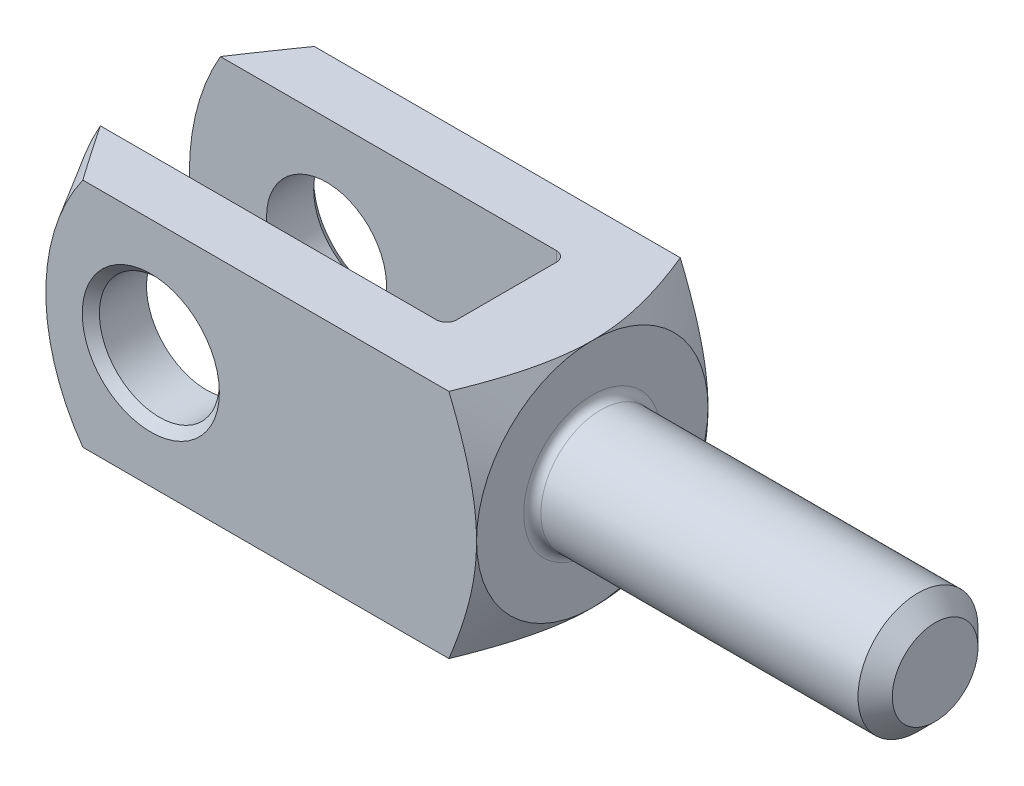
ISO-10303-21;
HEADER;
FILE_DESCRIPTION(('STEP AP214'),'2;1');
FILE_NAME('part.step','',(''),(''),'','','');
FILE_SCHEMA(('AUTOMOTIVE_DESIGN { 1 0 10303 214 1 1 1 1 }'));
ENDSEC;
DATA;
#1=APPLICATION_CONTEXT('core data for automotive mechanical design processes');
#2=APPLICATION_PROTOCOL_DEFINITION('international standard','automotive_design',2000,#1);
#3=PRODUCT_CONTEXT('',#1,'mechanical');
#4=PRODUCT('Part','Part','',(#3));
#5=PRODUCT_RELATED_PRODUCT_CATEGORY('part','',(#4));
#6=PRODUCT_DEFINITION_FORMATION('','',#4);
#7=PRODUCT_DEFINITION_CONTEXT('part definition',#1,'design');
#8=PRODUCT_DEFINITION('design','',#6,#7);
#9=PRODUCT_DEFINITION_SHAPE('','',#8);
#10=(LENGTH_UNIT() NAMED_UNIT(*) SI_UNIT(.MILLI.,.METRE.));
#11=(NAMED_UNIT(*) PLANE_ANGLE_UNIT() SI_UNIT($,.RADIAN.));
#12=(NAMED_UNIT(*) SI_UNIT($,.STERADIAN.) SOLID_ANGLE_UNIT());
#13=UNCERTAINTY_MEASURE_WITH_UNIT(LENGTH_MEASURE(1.E-05),#10,'distance_accuracy_value','');
#14=(GEOMETRIC_REPRESENTATION_CONTEXT(3) GLOBAL_UNCERTAINTY_ASSIGNED_CONTEXT((#13)) GLOBAL_UNIT_ASSIGNED_CONTEXT((#10,
#11,#12)) REPRESENTATION_CONTEXT('',''));
#15=CARTESIAN_POINT('',(0.,0.,0.));
#16=DIRECTION('',(0.,0.,1.));
#17=DIRECTION('',(1.,0.,0.));
#18=AXIS2_PLACEMENT_3D('',#15,#16,#17);
#19=CARTESIAN_POINT('',(-94.,-13.5,-6.99999999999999));
#20=DIRECTION('',(0.,0.,-1.));
#21=DIRECTION('',(-1.,0.,0.));
#22=AXIS2_PLACEMENT_3D('',#19,#20,#21);
#23=PLANE('',#22);
#24=CARTESIAN_POINT('',(-78.,0.,-6.99999999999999));
#25=DIRECTION('',(0.,0.,-1.));
#26=DIRECTION('',(-1.,0.,0.));
#27=AXIS2_PLACEMENT_3D('',#24,#25,#26);
#28=CIRCLE('',#27,7.);
#29=CARTESIAN_POINT('',(-85.,0.,-6.99999999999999));
#30=VERTEX_POINT('',#29);
#31=EDGE_CURVE('E160',#30,#30,#28,.F.);
#32=ORIENTED_EDGE('',*,*,#31,.F.);
#33=EDGE_LOOP('',(#32));
#34=FACE_BOUND('',#33,.T.);
#35=DIRECTION('',(-1.,0.,0.));
#36=VECTOR('',#35,1.);
#37=CARTESIAN_POINT('',(-94.,13.5,-6.99999999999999));
#38=LINE('',#37,#36);
#39=CARTESIAN_POINT('',(-51.2,13.5,-6.99999999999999));
#40=VERTEX_POINT('',#39);
#41=CARTESIAN_POINT('',(-90.3826859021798,13.5,-6.99999999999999));
#42=VERTEX_POINT('',#41);
#43=EDGE_CURVE('E320',#40,#42,#38,.T.);
#44=ORIENTED_EDGE('',*,*,#43,.T.);
#45=CARTESIAN_POINT('',(-67.,0.,-6.99999999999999));
#46=DIRECTION('',(0.,0.,1.));
#47=DIRECTION('',(1.,0.,0.));
#48=AXIS2_PLACEMENT_3D('',#45,#46,#47);
#49=CIRCLE('',#48,27.);
#50=CARTESIAN_POINT('',(-90.3826859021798,-13.5,-6.99999999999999));
#51=VERTEX_POINT('',#50);
#52=EDGE_CURVE('E61',#42,#51,#49,.T.);
#53=ORIENTED_EDGE('',*,*,#52,.T.);
#54=DIRECTION('',(-1.,0.,0.));
#55=VECTOR('',#54,1.);
#56=CARTESIAN_POINT('',(-94.,-13.5,-6.99999999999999));
#57=LINE('',#56,#55);
#58=CARTESIAN_POINT('',(-51.2,-13.5,-6.99999999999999));
#59=VERTEX_POINT('',#58);
#60=EDGE_CURVE('E312',#59,#51,#57,.T.);
#61=ORIENTED_EDGE('',*,*,#60,.F.);
#62=DIRECTION('',(0.,1.,0.));
#63=VECTOR('',#62,1.);
#64=CARTESIAN_POINT('',(-51.2,13.5,-6.99999999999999));
#65=LINE('',#64,#63);
#66=EDGE_CURVE('E183',#59,#40,#65,.T.);
#67=ORIENTED_EDGE('',*,*,#66,.T.);
#68=EDGE_LOOP('',(#44,#53,#61,#67));
#69=FACE_BOUND('',#68,.T.);
#70=ADVANCED_FACE('F37',(#34,#69),#23,.F.);
#71=CARTESIAN_POINT('',(-94.,-13.5,7.00000000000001));
#72=DIRECTION('',(0.,0.,1.));
#73=DIRECTION('',(1.,0.,0.));
#74=AXIS2_PLACEMENT_3D('',#71,#72,#73);
#75=PLANE('',#74);
#76=CARTESIAN_POINT('',(-78.,0.,7.00000000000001));
#77=DIRECTION('',(0.,0.,1.));
#78=DIRECTION('',(1.,0.,0.));
#79=AXIS2_PLACEMENT_3D('',#76,#77,#78);
#80=CIRCLE('',#79,7.);
#81=CARTESIAN_POINT('',(-71.,0.,7.00000000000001));
#82=VERTEX_POINT('',#81);
#83=EDGE_CURVE('E164',#82,#82,#80,.F.);
#84=ORIENTED_EDGE('',*,*,#83,.F.);
#85=EDGE_LOOP('',(#84));
#86=FACE_BOUND('',#85,.T.);
#87=CARTESIAN_POINT('',(-67.,0.,7.00000000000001));
#88=DIRECTION('',(0.,0.,1.));
#89=DIRECTION('',(1.,0.,0.));
#90=AXIS2_PLACEMENT_3D('',#87,#88,#89);
#91=CIRCLE('',#90,27.);
#92=CARTESIAN_POINT('',(-90.3826859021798,13.5,7.00000000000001));
#93=VERTEX_POINT('',#92);
#94=CARTESIAN_POINT('',(-90.3826859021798,-13.5,7.00000000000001));
#95=VERTEX_POINT('',#94);
#96=EDGE_CURVE('E128',#93,#95,#91,.T.);
#97=ORIENTED_EDGE('',*,*,#96,.F.);
#98=DIRECTION('',(1.,0.,0.));
#99=VECTOR('',#98,1.);
#100=CARTESIAN_POINT('',(-94.,13.5,7.00000000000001));
#101=LINE('',#100,#99);
#102=CARTESIAN_POINT('',(-51.2,13.5,7.));
#103=VERTEX_POINT('',#102);
#104=EDGE_CURVE('E324',#93,#103,#101,.T.);
#105=ORIENTED_EDGE('',*,*,#104,.T.);
#106=DIRECTION('',(0.,1.,0.));
#107=VECTOR('',#106,1.);
#108=CARTESIAN_POINT('',(-51.2,-13.5,7.));
#109=LINE('',#108,#107);
#110=CARTESIAN_POINT('',(-51.2,-13.5,7.));
#111=VERTEX_POINT('',#110);
#112=EDGE_CURVE('E179',#103,#111,#109,.F.);
#113=ORIENTED_EDGE('',*,*,#112,.T.);
#114=DIRECTION('',(1.,0.,0.));
#115=VECTOR('',#114,1.);
#116=CARTESIAN_POINT('',(-94.,-13.5,7.00000000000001));
#117=LINE('',#116,#115);
#118=EDGE_CURVE('E314',#95,#111,#117,.T.);
#119=ORIENTED_EDGE('',*,*,#118,.F.);
#120=EDGE_LOOP('',(#97,#105,#113,#119));
#121=FACE_BOUND('',#120,.T.);
#122=ADVANCED_FACE('F388',(#86,#121),#75,.F.);
#123=CARTESIAN_POINT('',(-94.,-13.5,13.5));
#124=DIRECTION('',(0.,0.,1.));
#125=DIRECTION('',(1.,0.,0.));
#126=AXIS2_PLACEMENT_3D('',#123,#124,#125);
#127=PLANE('',#126);
#128=CARTESIAN_POINT('',(-78.,0.,13.5));
#129=DIRECTION('',(0.,0.,1.));
#130=DIRECTION('',(1.,0.,0.));
#131=AXIS2_PLACEMENT_3D('',#128,#129,#130);
#132=CIRCLE('',#131,8.00000000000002);
#133=CARTESIAN_POINT('',(-70.,0.,13.5));
#134=VERTEX_POINT('',#133);
#135=EDGE_CURVE('E220',#134,#134,#132,.F.);
#136=ORIENTED_EDGE('',*,*,#135,.T.);
#137=EDGE_LOOP('',(#136));
#138=FACE_BOUND('',#137,.T.);
#139=DIRECTION('',(1.,0.,0.));
#140=VECTOR('',#139,1.);
#141=CARTESIAN_POINT('',(-94.,13.5,13.5));
#142=LINE('',#141,#140);
#143=CARTESIAN_POINT('',(-85.9257335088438,13.5,13.5));
#144=VERTEX_POINT('',#143);
#145=CARTESIAN_POINT('',(-43.2284752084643,13.5,13.5));
#146=VERTEX_POINT('',#145);
#147=EDGE_CURVE('E142',#144,#146,#142,.T.);
#148=ORIENTED_EDGE('',*,*,#147,.F.);
#149=CARTESIAN_POINT('',(-67.,0.,13.5));
#150=DIRECTION('',(0.,0.,1.));
#151=DIRECTION('',(1.,0.,0.));
#152=AXIS2_PLACEMENT_3D('',#149,#150,#151);
#153=CIRCLE('',#152,23.2472232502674);
#154=CARTESIAN_POINT('',(-85.9257335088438,-13.5,13.5));
#155=VERTEX_POINT('',#154);
#156=EDGE_CURVE('E53',#144,#155,#153,.T.);
#157=ORIENTED_EDGE('',*,*,#156,.T.);
#158=DIRECTION('',(1.,0.,0.));
#159=VECTOR('',#158,1.);
#160=CARTESIAN_POINT('',(-94.,-13.5,13.5));
#161=LINE('',#160,#159);
#162=CARTESIAN_POINT('',(-43.2284752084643,-13.5,13.5));
#163=VERTEX_POINT('',#162);
#164=EDGE_CURVE('E139',#155,#163,#161,.T.);
#165=ORIENTED_EDGE('',*,*,#164,.T.);
#166=CARTESIAN_POINT('',(-49.9304291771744,-27.5724587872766,13.5));
#167=CARTESIAN_POINT('',(-49.5854679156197,-26.9070980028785,13.5));
#168=CARTESIAN_POINT('',(-49.242330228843,-26.240782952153,13.5));
#169=CARTESIAN_POINT('',(-48.5606693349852,-24.9057532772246,13.5));
#170=CARTESIAN_POINT('',(-48.222146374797,-24.2370385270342,13.5));
#171=CARTESIAN_POINT('',(-47.5501346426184,-22.8956223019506,13.5));
#172=CARTESIAN_POINT('',(-47.2166556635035,-22.2229159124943,13.5));
#173=CARTESIAN_POINT('',(-46.5567154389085,-20.8740781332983,13.5));
#174=CARTESIAN_POINT('',(-46.2302540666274,-20.1979468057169,13.5));
#175=CARTESIAN_POINT('',(-45.5663268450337,-18.7997650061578,13.5));
#176=CARTESIAN_POINT('',(-45.2294196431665,-18.0774486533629,13.5));
#177=CARTESIAN_POINT('',(-44.5684159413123,-16.6268968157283,13.5));
#178=CARTESIAN_POINT('',(-44.2443201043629,-15.8986610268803,13.5));
#179=CARTESIAN_POINT('',(-43.7709527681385,-14.8009827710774,13.5));
#180=CARTESIAN_POINT('',(-43.6153242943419,-14.4342798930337,13.5));
#181=CARTESIAN_POINT('',(-43.3089711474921,-13.6988341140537,13.5));
#182=CARTESIAN_POINT('',(-43.1582463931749,-13.3300912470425,13.5));
#183=CARTESIAN_POINT('',(-42.8624766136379,-12.5903643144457,13.5));
#184=CARTESIAN_POINT('',(-42.717431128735,-12.2193804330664,13.5));
#185=CARTESIAN_POINT('',(-42.4339241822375,-11.4749116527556,13.5));
#186=CARTESIAN_POINT('',(-42.2954625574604,-11.1014268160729,13.5));
#187=CARTESIAN_POINT('',(-41.9969840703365,-10.2704027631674,13.5));
#188=CARTESIAN_POINT('',(-41.8388043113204,-9.81219978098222,13.5));
#189=CARTESIAN_POINT('',(-41.5360567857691,-8.89133812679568,13.5));
#190=CARTESIAN_POINT('',(-41.3914878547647,-8.42867983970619,13.5));
#191=CARTESIAN_POINT('',(-41.1186454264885,-7.49855908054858,13.5));
#192=CARTESIAN_POINT('',(-40.9903715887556,-7.03109670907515,13.5));
#193=CARTESIAN_POINT('',(-40.753182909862,-6.09124666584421,13.5));
#194=CARTESIAN_POINT('',(-40.6442678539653,-5.61885904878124,13.5));
#195=CARTESIAN_POINT('',(-40.4513715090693,-4.68052707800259,13.5));
#196=CARTESIAN_POINT('',(-40.3668649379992,-4.21469177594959,13.5));
#197=CARTESIAN_POINT('',(-40.2224231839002,-3.27919491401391,13.5));
#198=CARTESIAN_POINT('',(-40.162487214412,-2.80953347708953,13.5));
#199=CARTESIAN_POINT('',(-40.0696920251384,-1.86781820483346,13.5));
#200=CARTESIAN_POINT('',(-40.0368151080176,-1.39576613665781,13.5));
#201=CARTESIAN_POINT('',(-39.9995884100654,-0.450533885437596,13.5));
#202=CARTESIAN_POINT('',(-39.9952376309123,0.0226462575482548,13.5));
#203=CARTESIAN_POINT('',(-40.0145298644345,0.933916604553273,13.5));
#204=CARTESIAN_POINT('',(-40.0361561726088,1.37205133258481,13.5));
#205=CARTESIAN_POINT('',(-40.1032147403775,2.24647569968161,13.5));
#206=CARTESIAN_POINT('',(-40.1486469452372,2.68276534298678,13.5));
#207=CARTESIAN_POINT('',(-40.2616517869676,3.55266413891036,13.5));
#208=CARTESIAN_POINT('',(-40.3292358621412,3.98627178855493,13.5));
#209=CARTESIAN_POINT('',(-40.4843161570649,4.84988834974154,13.5));
#210=CARTESIAN_POINT('',(-40.5718129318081,5.27989716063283,13.5));
#211=CARTESIAN_POINT('',(-40.7670701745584,6.14834375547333,13.5));
#212=CARTESIAN_POINT('',(-40.8753438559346,6.58666526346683,13.5));
#213=CARTESIAN_POINT('',(-41.1077854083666,7.4590443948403,13.5));
#214=CARTESIAN_POINT('',(-41.2319534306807,7.89310197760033,13.5));
#215=CARTESIAN_POINT('',(-41.4937810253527,8.75708887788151,13.5));
#216=CARTESIAN_POINT('',(-41.6314399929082,9.18701837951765,13.5));
#217=CARTESIAN_POINT('',(-41.8464699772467,9.82901563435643,13.5));
#218=CARTESIAN_POINT('',(-41.9195690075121,10.0425285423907,13.5));
#219=CARTESIAN_POINT('',(-42.068387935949,10.4686386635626,13.5));
#220=CARTESIAN_POINT('',(-42.1441078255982,10.6812358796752,13.5));
#221=CARTESIAN_POINT('',(-42.3874050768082,11.3522977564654,13.5));
#222=CARTESIAN_POINT('',(-42.5593999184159,11.809164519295,13.5));
#223=CARTESIAN_POINT('',(-42.9127281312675,12.7192834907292,13.5));
#224=CARTESIAN_POINT('',(-43.0940620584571,13.1725354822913,13.5));
#225=CARTESIAN_POINT('',(-43.4645603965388,14.0759400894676,13.5));
#226=CARTESIAN_POINT('',(-43.6537265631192,14.5260919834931,13.5));
#227=CARTESIAN_POINT('',(-44.0385867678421,15.4235797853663,13.5));
#228=CARTESIAN_POINT('',(-44.2342806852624,15.8709157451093,13.5));
#229=CARTESIAN_POINT('',(-44.6313434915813,16.7635184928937,13.5));
#230=CARTESIAN_POINT('',(-44.8327171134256,17.2087831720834,13.5));
#231=CARTESIAN_POINT('',(-45.2401463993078,18.0971674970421,13.5));
#232=CARTESIAN_POINT('',(-45.4462021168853,18.540287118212,13.5));
#233=CARTESIAN_POINT('',(-46.0702761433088,19.8667324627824,13.5));
#234=CARTESIAN_POINT('',(-46.494251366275,20.7472561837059,13.5));
#235=CARTESIAN_POINT('',(-47.3552271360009,22.5052140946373,13.5));
#236=CARTESIAN_POINT('',(-47.7922634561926,23.3826306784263,13.5));
#237=CARTESIAN_POINT('',(-48.675287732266,25.1329651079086,13.5));
#238=CARTESIAN_POINT('',(-49.1212758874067,26.0058828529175,13.5));
#239=CARTESIAN_POINT('',(-50.0199360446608,27.7477195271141,13.5));
#240=CARTESIAN_POINT('',(-50.4726046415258,28.6166402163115,13.5));
#241=CARTESIAN_POINT('',(-51.3833677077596,30.3516218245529,13.5));
#242=CARTESIAN_POINT('',(-51.8414621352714,31.2176827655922,13.5));
#243=CARTESIAN_POINT('',(-52.6936403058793,32.8190461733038,13.5));
#244=CARTESIAN_POINT('',(-53.087127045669,33.5546666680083,13.5));
#245=CARTESIAN_POINT('',(-53.8767395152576,35.0244904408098,13.5));
#246=CARTESIAN_POINT('',(-54.2728652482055,35.7586937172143,13.5));
#247=CARTESIAN_POINT('',(-55.4646720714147,37.959711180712,13.5));
#248=CARTESIAN_POINT('',(-56.2636731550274,39.4247275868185,13.5));
#249=CARTESIAN_POINT('',(-57.8635150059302,42.3428467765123,13.5));
#250=CARTESIAN_POINT('',(-58.6643190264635,43.7959697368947,13.5));
#251=CARTESIAN_POINT('',(-59.8690675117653,45.973543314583,13.5));
#252=CARTESIAN_POINT('',(-60.2712089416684,46.6989923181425,13.5));
#253=CARTESIAN_POINT('',(-61.0765516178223,48.1493007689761,13.5));
#254=CARTESIAN_POINT('',(-61.4797528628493,48.8741602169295,13.5));
#255=CARTESIAN_POINT('',(-61.8834136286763,49.5987636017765,13.5));
#256=B_SPLINE_CURVE_WITH_KNOTS('',3,(#166,#167,#168,#169,#170,#171,#172,#173,#174,#175,#176,
#177,#178,#179,#180,#181,#182,#183,#184,#185,#186,#187,#188,#189,#190,#191,#192,#193,#194,#195,
#196,#197,#198,#199,#200,#201,#202,#203,#204,#205,#206,#207,#208,#209,#210,#211,#212,#213,#214,
#215,#216,#217,#218,#219,#220,#221,#222,#223,#224,#225,#226,#227,#228,#229,#230,#231,#232,#233,
#234,#235,#236,#237,#238,#239,#240,#241,#242,#243,#244,#245,#246,#247,#248,#249,#250,#251,#252,
#253,#254,#255),.UNSPECIFIED.,.F.,.F.,(4,2,2,2,2,2,2,2,2,2,2,2,2,2,2,2,2,2,2,2,2,2,2,2,2,2,2,2,
2,2,2,2,2,2,2,2,2,2,2,2,2,2,2,2,4),(0.,2.24841482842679,4.49694948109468,6.7493996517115,
9.00180908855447,11.3927930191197,13.7839005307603,14.9789541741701,16.1739880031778,
17.3689249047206,18.5638321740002,20.0178658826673,21.4717750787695,22.9256538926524,
24.379516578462,25.7992511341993,27.2189402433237,28.6377000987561,30.0564103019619,
31.3717442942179,32.6870752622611,34.0030864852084,35.3191343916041,36.6732741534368,
38.0274268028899,39.3815187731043,40.0585434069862,40.7355658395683,42.1999363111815,
43.6643940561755,45.1291818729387,46.5939426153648,48.0599622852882,49.5259987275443,
52.4577049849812,55.3983502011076,58.3390609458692,61.2783212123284,64.2175588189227,
66.7202960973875,69.2230363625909,74.2292153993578,79.2067218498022,81.6950831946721,
84.183441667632),.UNSPECIFIED.);
#257=CARTESIAN_POINT('',(-40.,0.,13.5));
#258=VERTEX_POINT('',#257);
#259=EDGE_CURVE('E284',#258,#163,#256,.F.);
#260=ORIENTED_EDGE('',*,*,#259,.F.);
#261=EDGE_CURVE('E282',#146,#258,#256,.F.);
#262=ORIENTED_EDGE('',*,*,#261,.F.);
#263=EDGE_LOOP('',(#148,#157,#165,#260,#262));
#264=FACE_BOUND('',#263,.T.);
#265=ADVANCED_FACE('F137',(#138,#264),#127,.T.);
#266=CARTESIAN_POINT('',(-94.,-13.5,13.5));
#267=DIRECTION('',(0.,-1.,0.));
#268=DIRECTION('',(0.,0.,-1.));
#269=AXIS2_PLACEMENT_3D('',#266,#267,#268);
#270=PLANE('',#269);
#271=ORIENTED_EDGE('',*,*,#60,.T.);
#272=CARTESIAN_POINT('',(-107.335378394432,-13.5,19.9067277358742));
#273=CARTESIAN_POINT('',(-106.589742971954,-13.5,18.6820817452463));
#274=CARTESIAN_POINT('',(-105.842635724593,-13.5,17.4583291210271));
#275=CARTESIAN_POINT('',(-104.344819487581,-13.5,15.0130165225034));
#276=CARTESIAN_POINT('',(-103.59411046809,-13.5,13.7914565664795));
#277=CARTESIAN_POINT('',(-102.08835575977,-13.5,11.350810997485));
#278=CARTESIAN_POINT('',(-101.33330956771,-13.5,10.1317256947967));
#279=CARTESIAN_POINT('',(-99.8180938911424,-13.5,7.69674639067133));
#280=CARTESIAN_POINT('',(-99.0579244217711,-13.5,6.48085237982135));
#281=CARTESIAN_POINT('',(-97.5330177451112,-13.5,4.05566502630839));
#282=CARTESIAN_POINT('',(-96.7682942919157,-13.5,2.84636304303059));
#283=CARTESIAN_POINT('',(-95.2311470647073,-13.5,0.432665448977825));
#284=CARTESIAN_POINT('',(-94.4587233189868,-13.5,-0.77173017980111));
#285=CARTESIAN_POINT('',(-92.9041541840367,-13.5,-3.1743133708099));
#286=CARTESIAN_POINT('',(-92.1220084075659,-13.5,-4.37250068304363));
#287=CARTESIAN_POINT('',(-90.9394271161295,-13.5,-6.1635918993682));
#288=CARTESIAN_POINT('',(-90.5436743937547,-13.5,-6.75958848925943));
#289=CARTESIAN_POINT('',(-89.7485806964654,-13.5,-7.94918226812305));
#290=CARTESIAN_POINT('',(-89.3492397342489,-13.5,-8.54277946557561));
#291=CARTESIAN_POINT('',(-88.5457822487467,-13.5,-9.72812510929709));
#292=CARTESIAN_POINT('',(-88.1416590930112,-13.5,-10.319869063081));
#293=CARTESIAN_POINT('',(-87.328600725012,-13.5,-11.500038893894));
#294=CARTESIAN_POINT('',(-86.9196655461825,-13.5,-12.0884647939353));
#295=CARTESIAN_POINT('',(-86.096256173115,-13.5,-13.2612199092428));
#296=CARTESIAN_POINT('',(-85.6817833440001,-13.5,-13.845550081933));
#297=CARTESIAN_POINT('',(-84.8461635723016,-13.5,-15.0094493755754));
#298=CARTESIAN_POINT('',(-84.4250164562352,-13.5,-15.5890183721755));
#299=CARTESIAN_POINT('',(-83.5742466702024,-13.5,-16.7429906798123));
#300=CARTESIAN_POINT('',(-83.1446143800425,-13.5,-17.3173869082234));
#301=CARTESIAN_POINT('',(-82.2757290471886,-13.5,-18.4588171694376));
#302=CARTESIAN_POINT('',(-81.8364767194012,-13.5,-19.0258517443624));
#303=CARTESIAN_POINT('',(-81.1685494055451,-13.5,-19.8695905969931));
#304=CARTESIAN_POINT('',(-80.9443098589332,-13.5,-20.1498090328));
#305=CARTESIAN_POINT('',(-80.4925201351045,-13.5,-20.7075596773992));
#306=CARTESIAN_POINT('',(-80.2649700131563,-13.5,-20.9850919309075));
#307=CARTESIAN_POINT('',(-79.8061154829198,-13.5,-21.5371561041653));
#308=CARTESIAN_POINT('',(-79.5748101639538,-13.5,-21.811687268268));
#309=CARTESIAN_POINT('',(-79.108015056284,-13.5,-22.3571941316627));
#310=CARTESIAN_POINT('',(-78.8725250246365,-13.5,-22.628169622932));
#311=CARTESIAN_POINT('',(-78.6347136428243,-13.5,-22.8971084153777));
#312=B_SPLINE_CURVE_WITH_KNOTS('',3,(#272,#273,#274,#275,#276,#277,#278,#279,#280,#281,#282,
#283,#284,#285,#286,#287,#288,#289,#290,#291,#292,#293,#294,#295,#296,#297,#298,#299,#300,#301,
#302,#303,#304,#305,#306,#307,#308,#309,#310,#311),.UNSPECIFIED.,.F.,.F.,(4,2,2,2,2,2,2,2,2,2,2,
2,2,2,2,2,2,2,2,4),(0.,4.30134760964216,8.60273091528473,12.904623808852,17.206503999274,
21.4989060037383,25.7912922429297,30.0838500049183,32.2301130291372,34.376368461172,
36.5260664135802,38.6757494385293,40.8249119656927,42.9741304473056,45.1259441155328,
47.2775984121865,48.3542633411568,49.4309103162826,50.5078224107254,51.5847972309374),.UNSPECIFIED.);
#313=CARTESIAN_POINT('',(-85.9257335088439,-13.5,-13.5));
#314=VERTEX_POINT('',#313);
#315=EDGE_CURVE('E133',#51,#314,#312,.T.);
#316=ORIENTED_EDGE('',*,*,#315,.T.);
#317=DIRECTION('',(1.,0.,0.));
#318=VECTOR('',#317,1.);
#319=CARTESIAN_POINT('',(-94.,-13.5,-13.5));
#320=LINE('',#319,#318);
#321=CARTESIAN_POINT('',(-43.2284752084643,-13.5,-13.5));
#322=VERTEX_POINT('',#321);
#323=EDGE_CURVE('E152',#314,#322,#320,.T.);
#324=ORIENTED_EDGE('',*,*,#323,.T.);
#325=CARTESIAN_POINT('',(-49.9304291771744,-13.5,-27.5724587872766));
#326=CARTESIAN_POINT('',(-49.5854679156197,-13.5,-26.9070980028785));
#327=CARTESIAN_POINT('',(-49.242330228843,-13.5,-26.240782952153));
#328=CARTESIAN_POINT('',(-48.5606693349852,-13.5,-24.9057532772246));
#329=CARTESIAN_POINT('',(-48.222146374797,-13.5,-24.2370385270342));
#330=CARTESIAN_POINT('',(-47.5501346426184,-13.5,-22.8956223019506));
#331=CARTESIAN_POINT('',(-47.2166556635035,-13.5,-22.2229159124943));
#332=CARTESIAN_POINT('',(-46.5567154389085,-13.5,-20.8740781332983));
#333=CARTESIAN_POINT('',(-46.2302540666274,-13.5,-20.1979468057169));
#334=CARTESIAN_POINT('',(-45.5663268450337,-13.5,-18.7997650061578));
#335=CARTESIAN_POINT('',(-45.2294196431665,-13.5,-18.0774486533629));
#336=CARTESIAN_POINT('',(-44.5684159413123,-13.5,-16.6268968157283));
#337=CARTESIAN_POINT('',(-44.2443201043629,-13.5,-15.8986610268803));
#338=CARTESIAN_POINT('',(-43.7709527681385,-13.5,-14.8009827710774));
#339=CARTESIAN_POINT('',(-43.6153242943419,-13.5,-14.4342798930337));
#340=CARTESIAN_POINT('',(-43.3089711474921,-13.5,-13.6988341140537));
#341=CARTESIAN_POINT('',(-43.1582463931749,-13.5,-13.3300912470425));
#342=CARTESIAN_POINT('',(-42.8624766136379,-13.5,-12.5903643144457));
#343=CARTESIAN_POINT('',(-42.717431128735,-13.5,-12.2193804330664));
#344=CARTESIAN_POINT('',(-42.4339241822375,-13.5,-11.4749116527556));
#345=CARTESIAN_POINT('',(-42.2954625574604,-13.5,-11.1014268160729));
#346=CARTESIAN_POINT('',(-41.9969840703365,-13.5,-10.2704027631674));
#347=CARTESIAN_POINT('',(-41.8388043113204,-13.5,-9.81219978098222));
#348=CARTESIAN_POINT('',(-41.5360567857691,-13.5,-8.89133812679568));
#349=CARTESIAN_POINT('',(-41.3914878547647,-13.5,-8.42867983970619));
#350=CARTESIAN_POINT('',(-41.1186454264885,-13.5,-7.49855908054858));
#351=CARTESIAN_POINT('',(-40.9903715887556,-13.5,-7.03109670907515));
#352=CARTESIAN_POINT('',(-40.753182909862,-13.5,-6.09124666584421));
#353=CARTESIAN_POINT('',(-40.6442678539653,-13.5,-5.61885904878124));
#354=CARTESIAN_POINT('',(-40.4513715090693,-13.5,-4.68052707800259));
#355=CARTESIAN_POINT('',(-40.3668649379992,-13.5,-4.21469177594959));
#356=CARTESIAN_POINT('',(-40.2224231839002,-13.5,-3.27919491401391));
#357=CARTESIAN_POINT('',(-40.162487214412,-13.5,-2.80953347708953));
#358=CARTESIAN_POINT('',(-40.0696920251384,-13.5,-1.86781820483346));
#359=CARTESIAN_POINT('',(-40.0368151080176,-13.5,-1.39576613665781));
#360=CARTESIAN_POINT('',(-39.9995884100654,-13.5,-0.450533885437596));
#361=CARTESIAN_POINT('',(-39.9952376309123,-13.5,0.0226462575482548));
#362=CARTESIAN_POINT('',(-40.0145298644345,-13.5,0.933916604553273));
#363=CARTESIAN_POINT('',(-40.0361561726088,-13.5,1.37205133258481));
#364=CARTESIAN_POINT('',(-40.1032147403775,-13.5,2.24647569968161));
#365=CARTESIAN_POINT('',(-40.1486469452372,-13.5,2.68276534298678));
#366=CARTESIAN_POINT('',(-40.2616517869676,-13.5,3.55266413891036));
#367=CARTESIAN_POINT('',(-40.3292358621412,-13.5,3.98627178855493));
#368=CARTESIAN_POINT('',(-40.4843161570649,-13.5,4.84988834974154));
#369=CARTESIAN_POINT('',(-40.5718129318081,-13.5,5.27989716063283));
#370=CARTESIAN_POINT('',(-40.7670701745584,-13.5,6.14834375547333));
#371=CARTESIAN_POINT('',(-40.8753438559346,-13.5,6.58666526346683));
#372=CARTESIAN_POINT('',(-41.1077854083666,-13.5,7.4590443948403));
#373=CARTESIAN_POINT('',(-41.2319534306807,-13.5,7.89310197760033));
#374=CARTESIAN_POINT('',(-41.4937810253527,-13.5,8.75708887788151));
#375=CARTESIAN_POINT('',(-41.6314399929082,-13.5,9.18701837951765));
#376=CARTESIAN_POINT('',(-41.8464699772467,-13.5,9.82901563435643));
#377=CARTESIAN_POINT('',(-41.9195690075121,-13.5,10.0425285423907));
#378=CARTESIAN_POINT('',(-42.068387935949,-13.5,10.4686386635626));
#379=CARTESIAN_POINT('',(-42.1441078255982,-13.5,10.6812358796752));
#380=CARTESIAN_POINT('',(-42.3874050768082,-13.5,11.3522977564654));
#381=CARTESIAN_POINT('',(-42.5593999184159,-13.5,11.809164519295));
#382=CARTESIAN_POINT('',(-42.9127281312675,-13.5,12.7192834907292));
#383=CARTESIAN_POINT('',(-43.0940620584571,-13.5,13.1725354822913));
#384=CARTESIAN_POINT('',(-43.4645603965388,-13.5,14.0759400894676));
#385=CARTESIAN_POINT('',(-43.6537265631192,-13.5,14.5260919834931));
#386=CARTESIAN_POINT('',(-44.0385867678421,-13.5,15.4235797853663));
#387=CARTESIAN_POINT('',(-44.2342806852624,-13.5,15.8709157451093));
#388=CARTESIAN_POINT('',(-44.6313434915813,-13.5,16.7635184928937));
#389=CARTESIAN_POINT('',(-44.8327171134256,-13.5,17.2087831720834));
#390=CARTESIAN_POINT('',(-45.2401463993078,-13.5,18.0971674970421));
#391=CARTESIAN_POINT('',(-45.4462021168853,-13.5,18.540287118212));
#392=CARTESIAN_POINT('',(-46.0702761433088,-13.5,19.8667324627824));
#393=CARTESIAN_POINT('',(-46.494251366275,-13.5,20.7472561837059));
#394=CARTESIAN_POINT('',(-47.3552271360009,-13.5,22.5052140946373));
#395=CARTESIAN_POINT('',(-47.7922634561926,-13.5,23.3826306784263));
#396=CARTESIAN_POINT('',(-48.675287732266,-13.5,25.1329651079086));
#397=CARTESIAN_POINT('',(-49.1212758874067,-13.5,26.0058828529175));
#398=CARTESIAN_POINT('',(-50.0199360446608,-13.5,27.7477195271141));
#399=CARTESIAN_POINT('',(-50.4726046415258,-13.5,28.6166402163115));
#400=CARTESIAN_POINT('',(-51.3833677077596,-13.5,30.3516218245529));
#401=CARTESIAN_POINT('',(-51.8414621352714,-13.5,31.2176827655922));
#402=CARTESIAN_POINT('',(-52.6936403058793,-13.5,32.8190461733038));
#403=CARTESIAN_POINT('',(-53.087127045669,-13.5,33.5546666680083));
#404=CARTESIAN_POINT('',(-53.8767395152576,-13.5,35.0244904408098));
#405=CARTESIAN_POINT('',(-54.2728652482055,-13.5,35.7586937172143));
#406=CARTESIAN_POINT('',(-55.4646720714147,-13.5,37.959711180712));
#407=CARTESIAN_POINT('',(-56.2636731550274,-13.5,39.4247275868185));
#408=CARTESIAN_POINT('',(-57.8635150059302,-13.5,42.3428467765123));
#409=CARTESIAN_POINT('',(-58.6643190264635,-13.5,43.7959697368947));
#410=CARTESIAN_POINT('',(-59.8690675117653,-13.5,45.973543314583));
#411=CARTESIAN_POINT('',(-60.2712089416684,-13.5,46.6989923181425));
#412=CARTESIAN_POINT('',(-61.0765516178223,-13.5,48.1493007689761));
#413=CARTESIAN_POINT('',(-61.4797528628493,-13.5,48.8741602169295));
#414=CARTESIAN_POINT('',(-61.8834136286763,-13.5,49.5987636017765));
#415=B_SPLINE_CURVE_WITH_KNOTS('',3,(#325,#326,#327,#328,#329,#330,#331,#332,#333,#334,#335,
#336,#337,#338,#339,#340,#341,#342,#343,#344,#345,#346,#347,#348,#349,#350,#351,#352,#353,#354,
#355,#356,#357,#358,#359,#360,#361,#362,#363,#364,#365,#366,#367,#368,#369,#370,#371,#372,#373,
#374,#375,#376,#377,#378,#379,#380,#381,#382,#383,#384,#385,#386,#387,#388,#389,#390,#391,#392,
#393,#394,#395,#396,#397,#398,#399,#400,#401,#402,#403,#404,#405,#406,#407,#408,#409,#410,#411,
#412,#413,#414),.UNSPECIFIED.,.F.,.F.,(4,2,2,2,2,2,2,2,2,2,2,2,2,2,2,2,2,2,2,2,2,2,2,2,2,2,2,2,
2,2,2,2,2,2,2,2,2,2,2,2,2,2,2,2,4),(0.,2.24841482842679,4.49694948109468,6.7493996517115,
9.00180908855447,11.3927930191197,13.7839005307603,14.9789541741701,16.1739880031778,
17.3689249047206,18.5638321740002,20.0178658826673,21.4717750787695,22.9256538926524,
24.379516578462,25.7992511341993,27.2189402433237,28.6377000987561,30.0564103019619,
31.3717442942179,32.6870752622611,34.0030864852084,35.3191343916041,36.6732741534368,
38.0274268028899,39.3815187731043,40.0585434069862,40.7355658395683,42.1999363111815,
43.6643940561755,45.1291818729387,46.5939426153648,48.0599622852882,49.5259987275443,
52.4577049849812,55.3983502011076,58.3390609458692,61.2783212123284,64.2175588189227,
66.7202960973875,69.2230363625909,74.2292153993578,79.2067218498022,81.6950831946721,
84.183441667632),.UNSPECIFIED.);
#416=CARTESIAN_POINT('',(-40.,-13.5,0.));
#417=VERTEX_POINT('',#416);
#418=EDGE_CURVE('E283',#417,#322,#415,.F.);
#419=ORIENTED_EDGE('',*,*,#418,.F.);
#420=EDGE_CURVE('E150',#163,#417,#415,.F.);
#421=ORIENTED_EDGE('',*,*,#420,.F.);
#422=ORIENTED_EDGE('',*,*,#164,.F.);
#423=CARTESIAN_POINT('',(-78.6347136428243,-13.5,22.8971084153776));
#424=CARTESIAN_POINT('',(-78.8725250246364,-13.5,22.6281696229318));
#425=CARTESIAN_POINT('',(-79.108015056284,-13.5,22.3571941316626));
#426=CARTESIAN_POINT('',(-79.5748101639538,-13.5,21.8116872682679));
#427=CARTESIAN_POINT('',(-79.8061154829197,-13.5,21.5371561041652));
#428=CARTESIAN_POINT('',(-80.2649700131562,-13.5,20.9850919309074));
#429=CARTESIAN_POINT('',(-80.4925201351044,-13.5,20.7075596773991));
#430=CARTESIAN_POINT('',(-80.9443098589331,-13.5,20.1498090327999));
#431=CARTESIAN_POINT('',(-81.168549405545,-13.5,19.869590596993));
#432=CARTESIAN_POINT('',(-81.8364767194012,-13.5,19.0258517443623));
#433=CARTESIAN_POINT('',(-82.2757290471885,-13.5,18.4588171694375));
#434=CARTESIAN_POINT('',(-83.1446143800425,-13.5,17.3173869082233));
#435=CARTESIAN_POINT('',(-83.5742466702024,-13.5,16.7429906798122));
#436=CARTESIAN_POINT('',(-84.4250164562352,-13.5,15.5890183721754));
#437=CARTESIAN_POINT('',(-84.8461635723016,-13.5,15.0094493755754));
#438=CARTESIAN_POINT('',(-85.6817833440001,-13.5,13.8455500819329));
#439=CARTESIAN_POINT('',(-86.096256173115,-13.5,13.2612199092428));
#440=CARTESIAN_POINT('',(-86.9196655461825,-13.5,12.0884647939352));
#441=CARTESIAN_POINT('',(-87.328600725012,-13.5,11.500038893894));
#442=CARTESIAN_POINT('',(-88.1416590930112,-13.5,10.319869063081));
#443=CARTESIAN_POINT('',(-88.5457822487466,-13.5,9.72812510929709));
#444=CARTESIAN_POINT('',(-89.3492397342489,-13.5,8.54277946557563));
#445=CARTESIAN_POINT('',(-89.7485806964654,-13.5,7.94918226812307));
#446=CARTESIAN_POINT('',(-90.5436743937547,-13.5,6.75958848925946));
#447=CARTESIAN_POINT('',(-90.9394271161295,-13.5,6.16359189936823));
#448=CARTESIAN_POINT('',(-92.1220084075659,-13.5,4.37250068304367));
#449=CARTESIAN_POINT('',(-92.9041541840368,-13.5,3.17431337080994));
#450=CARTESIAN_POINT('',(-94.4587233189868,-13.5,0.771730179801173));
#451=CARTESIAN_POINT('',(-95.2311470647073,-13.5,-0.432665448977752));
#452=CARTESIAN_POINT('',(-96.7682942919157,-13.5,-2.8463630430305));
#453=CARTESIAN_POINT('',(-97.5330177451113,-13.5,-4.05566502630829));
#454=CARTESIAN_POINT('',(-99.0579244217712,-13.5,-6.48085237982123));
#455=CARTESIAN_POINT('',(-99.8180938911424,-13.5,-7.6967463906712));
#456=CARTESIAN_POINT('',(-101.33330956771,-13.5,-10.1317256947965));
#457=CARTESIAN_POINT('',(-102.08835575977,-13.5,-11.3508109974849));
#458=CARTESIAN_POINT('',(-103.59411046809,-13.5,-13.7914565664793));
#459=CARTESIAN_POINT('',(-104.344819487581,-13.5,-15.0130165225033));
#460=CARTESIAN_POINT('',(-105.842635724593,-13.5,-17.4583291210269));
#461=CARTESIAN_POINT('',(-106.589742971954,-13.5,-18.6820817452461));
#462=CARTESIAN_POINT('',(-107.335378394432,-13.5,-19.906727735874));
#463=B_SPLINE_CURVE_WITH_KNOTS('',3,(#423,#424,#425,#426,#427,#428,#429,#430,#431,#432,#433,
#434,#435,#436,#437,#438,#439,#440,#441,#442,#443,#444,#445,#446,#447,#448,#449,#450,#451,#452,
#453,#454,#455,#456,#457,#458,#459,#460,#461,#462),.UNSPECIFIED.,.F.,.F.,(4,2,2,2,2,2,2,2,2,2,2,
2,2,2,2,2,2,2,2,4),(0.,1.07697482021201,2.15388691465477,3.23053388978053,4.3071988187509,
6.45885311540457,8.6106667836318,10.7598852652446,12.9090477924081,15.0587308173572,
17.2084287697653,19.3546842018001,21.500947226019,25.7935049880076,30.0858912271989,
34.3782932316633,38.6801734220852,42.9820663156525,47.2834496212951,51.5847972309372),.UNSPECIFIED.);
#464=EDGE_CURVE('E125',#155,#95,#463,.T.);
#465=ORIENTED_EDGE('',*,*,#464,.T.);
#466=ORIENTED_EDGE('',*,*,#118,.T.);
#467=CARTESIAN_POINT('',(-51.2,-13.5,5.8));
#468=DIRECTION('',(0.,-1.,0.));
#469=DIRECTION('',(0.,0.,-1.));
#470=AXIS2_PLACEMENT_3D('',#467,#468,#469);
#471=CIRCLE('',#470,1.2);
#472=CARTESIAN_POINT('',(-50.,-13.5,5.8));
#473=VERTEX_POINT('',#472);
#474=EDGE_CURVE('E191',#111,#473,#471,.F.);
#475=ORIENTED_EDGE('',*,*,#474,.T.);
#476=DIRECTION('',(0.,0.,-1.));
#477=VECTOR('',#476,1.);
#478=CARTESIAN_POINT('',(-50.,-13.5,-6.99999999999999));
#479=LINE('',#478,#477);
#480=CARTESIAN_POINT('',(-50.,-13.5,-5.79999999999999));
#481=VERTEX_POINT('',#480);
#482=EDGE_CURVE('E168',#473,#481,#479,.T.);
#483=ORIENTED_EDGE('',*,*,#482,.T.);
#484=CARTESIAN_POINT('',(-51.2,-13.5,-5.79999999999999));
#485=DIRECTION('',(0.,-1.,0.));
#486=DIRECTION('',(0.,0.,-1.));
#487=AXIS2_PLACEMENT_3D('',#484,#485,#486);
#488=CIRCLE('',#487,1.2);
#489=EDGE_CURVE('E197',#481,#59,#488,.F.);
#490=ORIENTED_EDGE('',*,*,#489,.T.);
#491=EDGE_LOOP('',(#271,#316,#324,#419,#421,#422,#465,#466,#475,#483,#490));
#492=FACE_BOUND('',#491,.T.);
#493=ADVANCED_FACE('F148',(#492),#270,.T.);
#494=CARTESIAN_POINT('',(-94.,-13.5,-13.5));
#495=DIRECTION('',(0.,0.,-1.));
#496=DIRECTION('',(-1.,0.,0.));
#497=AXIS2_PLACEMENT_3D('',#494,#495,#496);
#498=PLANE('',#497);
#499=CARTESIAN_POINT('',(-78.,0.,-13.5));
#500=DIRECTION('',(0.,0.,-1.));
#501=DIRECTION('',(-1.,0.,0.));
#502=AXIS2_PLACEMENT_3D('',#499,#500,#501);
#503=CIRCLE('',#502,7.99999999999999);
#504=CARTESIAN_POINT('',(-86.,0.,-13.5));
#505=VERTEX_POINT('',#504);
#506=EDGE_CURVE('E208',#505,#505,#503,.F.);
#507=ORIENTED_EDGE('',*,*,#506,.T.);
#508=EDGE_LOOP('',(#507));
#509=FACE_BOUND('',#508,.T.);
#510=ORIENTED_EDGE('',*,*,#323,.F.);
#511=CARTESIAN_POINT('',(-67.,0.,-13.5));
#512=DIRECTION('',(0.,0.,1.));
#513=DIRECTION('',(1.,0.,0.));
#514=AXIS2_PLACEMENT_3D('',#511,#512,#513);
#515=CIRCLE('',#514,23.2472232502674);
#516=CARTESIAN_POINT('',(-85.9257335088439,13.5,-13.5));
#517=VERTEX_POINT('',#516);
#518=EDGE_CURVE('E144',#517,#314,#515,.T.);
#519=ORIENTED_EDGE('',*,*,#518,.F.);
#520=DIRECTION('',(1.,0.,0.));
#521=VECTOR('',#520,1.);
#522=CARTESIAN_POINT('',(-94.,13.5,-13.5));
#523=LINE('',#522,#521);
#524=CARTESIAN_POINT('',(-43.2284752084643,13.5,-13.5));
#525=VERTEX_POINT('',#524);
#526=EDGE_CURVE('E157',#517,#525,#523,.T.);
#527=ORIENTED_EDGE('',*,*,#526,.T.);
#528=CARTESIAN_POINT('',(-49.9304291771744,-27.5724587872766,-13.5));
#529=CARTESIAN_POINT('',(-49.5854679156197,-26.9070980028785,-13.5));
#530=CARTESIAN_POINT('',(-49.242330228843,-26.240782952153,-13.5));
#531=CARTESIAN_POINT('',(-48.5606693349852,-24.9057532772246,-13.5));
#532=CARTESIAN_POINT('',(-48.222146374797,-24.2370385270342,-13.5));
#533=CARTESIAN_POINT('',(-47.5501346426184,-22.8956223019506,-13.5));
#534=CARTESIAN_POINT('',(-47.2166556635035,-22.2229159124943,-13.5));
#535=CARTESIAN_POINT('',(-46.5567154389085,-20.8740781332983,-13.5));
#536=CARTESIAN_POINT('',(-46.2302540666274,-20.1979468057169,-13.5));
#537=CARTESIAN_POINT('',(-45.5663268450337,-18.7997650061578,-13.5));
#538=CARTESIAN_POINT('',(-45.2294196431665,-18.0774486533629,-13.5));
#539=CARTESIAN_POINT('',(-44.5684159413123,-16.6268968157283,-13.5));
#540=CARTESIAN_POINT('',(-44.2443201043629,-15.8986610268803,-13.5));
#541=CARTESIAN_POINT('',(-43.7709527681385,-14.8009827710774,-13.5));
#542=CARTESIAN_POINT('',(-43.6153242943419,-14.4342798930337,-13.5));
#543=CARTESIAN_POINT('',(-43.3089711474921,-13.6988341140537,-13.5));
#544=CARTESIAN_POINT('',(-43.1582463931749,-13.3300912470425,-13.5));
#545=CARTESIAN_POINT('',(-42.8624766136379,-12.5903643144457,-13.5));
#546=CARTESIAN_POINT('',(-42.717431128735,-12.2193804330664,-13.5));
#547=CARTESIAN_POINT('',(-42.4339241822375,-11.4749116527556,-13.5));
#548=CARTESIAN_POINT('',(-42.2954625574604,-11.1014268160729,-13.5));
#549=CARTESIAN_POINT('',(-41.9969840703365,-10.2704027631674,-13.5));
#550=CARTESIAN_POINT('',(-41.8388043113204,-9.81219978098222,-13.5));
#551=CARTESIAN_POINT('',(-41.5360567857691,-8.89133812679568,-13.5));
#552=CARTESIAN_POINT('',(-41.3914878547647,-8.42867983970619,-13.5));
#553=CARTESIAN_POINT('',(-41.1186454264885,-7.49855908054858,-13.5));
#554=CARTESIAN_POINT('',(-40.9903715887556,-7.03109670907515,-13.5));
#555=CARTESIAN_POINT('',(-40.753182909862,-6.09124666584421,-13.5));
#556=CARTESIAN_POINT('',(-40.6442678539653,-5.61885904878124,-13.5));
#557=CARTESIAN_POINT('',(-40.4513715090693,-4.68052707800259,-13.5));
#558=CARTESIAN_POINT('',(-40.3668649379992,-4.21469177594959,-13.5));
#559=CARTESIAN_POINT('',(-40.2224231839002,-3.27919491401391,-13.5));
#560=CARTESIAN_POINT('',(-40.162487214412,-2.80953347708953,-13.5));
#561=CARTESIAN_POINT('',(-40.0696920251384,-1.86781820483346,-13.5));
#562=CARTESIAN_POINT('',(-40.0368151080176,-1.39576613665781,-13.5));
#563=CARTESIAN_POINT('',(-39.9995884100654,-0.450533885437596,-13.5));
#564=CARTESIAN_POINT('',(-39.9952376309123,0.0226462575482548,-13.5));
#565=CARTESIAN_POINT('',(-40.0145298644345,0.933916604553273,-13.5));
#566=CARTESIAN_POINT('',(-40.0361561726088,1.37205133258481,-13.5));
#567=CARTESIAN_POINT('',(-40.1032147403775,2.24647569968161,-13.5));
#568=CARTESIAN_POINT('',(-40.1486469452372,2.68276534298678,-13.5));
#569=CARTESIAN_POINT('',(-40.2616517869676,3.55266413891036,-13.5));
#570=CARTESIAN_POINT('',(-40.3292358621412,3.98627178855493,-13.5));
#571=CARTESIAN_POINT('',(-40.4843161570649,4.84988834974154,-13.5));
#572=CARTESIAN_POINT('',(-40.5718129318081,5.27989716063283,-13.5));
#573=CARTESIAN_POINT('',(-40.7670701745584,6.14834375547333,-13.5));
#574=CARTESIAN_POINT('',(-40.8753438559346,6.58666526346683,-13.5));
#575=CARTESIAN_POINT('',(-41.1077854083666,7.4590443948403,-13.5));
#576=CARTESIAN_POINT('',(-41.2319534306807,7.89310197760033,-13.5));
#577=CARTESIAN_POINT('',(-41.4937810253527,8.75708887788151,-13.5));
#578=CARTESIAN_POINT('',(-41.6314399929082,9.18701837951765,-13.5));
#579=CARTESIAN_POINT('',(-41.8464699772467,9.82901563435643,-13.5));
#580=CARTESIAN_POINT('',(-41.9195690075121,10.0425285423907,-13.5));
#581=CARTESIAN_POINT('',(-42.068387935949,10.4686386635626,-13.5));
#582=CARTESIAN_POINT('',(-42.1441078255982,10.6812358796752,-13.5));
#583=CARTESIAN_POINT('',(-42.3874050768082,11.3522977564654,-13.5));
#584=CARTESIAN_POINT('',(-42.5593999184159,11.809164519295,-13.5));
#585=CARTESIAN_POINT('',(-42.9127281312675,12.7192834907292,-13.5));
#586=CARTESIAN_POINT('',(-43.0940620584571,13.1725354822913,-13.5));
#587=CARTESIAN_POINT('',(-43.4645603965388,14.0759400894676,-13.5));
#588=CARTESIAN_POINT('',(-43.6537265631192,14.5260919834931,-13.5));
#589=CARTESIAN_POINT('',(-44.0385867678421,15.4235797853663,-13.5));
#590=CARTESIAN_POINT('',(-44.2342806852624,15.8709157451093,-13.5));
#591=CARTESIAN_POINT('',(-44.6313434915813,16.7635184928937,-13.5));
#592=CARTESIAN_POINT('',(-44.8327171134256,17.2087831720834,-13.5));
#593=CARTESIAN_POINT('',(-45.2401463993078,18.0971674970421,-13.5));
#594=CARTESIAN_POINT('',(-45.4462021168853,18.540287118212,-13.5));
#595=CARTESIAN_POINT('',(-46.0702761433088,19.8667324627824,-13.5));
#596=CARTESIAN_POINT('',(-46.494251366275,20.7472561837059,-13.5));
#597=CARTESIAN_POINT('',(-47.3552271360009,22.5052140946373,-13.5));
#598=CARTESIAN_POINT('',(-47.7922634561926,23.3826306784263,-13.5));
#599=CARTESIAN_POINT('',(-48.675287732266,25.1329651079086,-13.5));
#600=CARTESIAN_POINT('',(-49.1212758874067,26.0058828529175,-13.5));
#601=CARTESIAN_POINT('',(-50.0199360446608,27.7477195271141,-13.5));
#602=CARTESIAN_POINT('',(-50.4726046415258,28.6166402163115,-13.5));
#603=CARTESIAN_POINT('',(-51.3833677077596,30.3516218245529,-13.5));
#604=CARTESIAN_POINT('',(-51.8414621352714,31.2176827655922,-13.5));
#605=CARTESIAN_POINT('',(-52.6936403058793,32.8190461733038,-13.5));
#606=CARTESIAN_POINT('',(-53.087127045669,33.5546666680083,-13.5));
#607=CARTESIAN_POINT('',(-53.8767395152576,35.0244904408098,-13.5));
#608=CARTESIAN_POINT('',(-54.2728652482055,35.7586937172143,-13.5));
#609=CARTESIAN_POINT('',(-55.4646720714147,37.959711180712,-13.5));
#610=CARTESIAN_POINT('',(-56.2636731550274,39.4247275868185,-13.5));
#611=CARTESIAN_POINT('',(-57.8635150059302,42.3428467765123,-13.5));
#612=CARTESIAN_POINT('',(-58.6643190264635,43.7959697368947,-13.5));
#613=CARTESIAN_POINT('',(-59.8690675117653,45.973543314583,-13.5));
#614=CARTESIAN_POINT('',(-60.2712089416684,46.6989923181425,-13.5));
#615=CARTESIAN_POINT('',(-61.0765516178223,48.1493007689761,-13.5));
#616=CARTESIAN_POINT('',(-61.4797528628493,48.8741602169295,-13.5));
#617=CARTESIAN_POINT('',(-61.8834136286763,49.5987636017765,-13.5));
#618=B_SPLINE_CURVE_WITH_KNOTS('',3,(#528,#529,#530,#531,#532,#533,#534,#535,#536,#537,#538,
#539,#540,#541,#542,#543,#544,#545,#546,#547,#548,#549,#550,#551,#552,#553,#554,#555,#556,#557,
#558,#559,#560,#561,#562,#563,#564,#565,#566,#567,#568,#569,#570,#571,#572,#573,#574,#575,#576,
#577,#578,#579,#580,#581,#582,#583,#584,#585,#586,#587,#588,#589,#590,#591,#592,#593,#594,#595,
#596,#597,#598,#599,#600,#601,#602,#603,#604,#605,#606,#607,#608,#609,#610,#611,#612,#613,#614,
#615,#616,#617),.UNSPECIFIED.,.F.,.F.,(4,2,2,2,2,2,2,2,2,2,2,2,2,2,2,2,2,2,2,2,2,2,2,2,2,2,2,2,
2,2,2,2,2,2,2,2,2,2,2,2,2,2,2,2,4),(0.,2.24841482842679,4.49694948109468,6.7493996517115,
9.00180908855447,11.3927930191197,13.7839005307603,14.9789541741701,16.1739880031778,
17.3689249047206,18.5638321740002,20.0178658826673,21.4717750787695,22.9256538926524,
24.379516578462,25.7992511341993,27.2189402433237,28.6377000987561,30.0564103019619,
31.3717442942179,32.6870752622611,34.0030864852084,35.3191343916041,36.6732741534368,
38.0274268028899,39.3815187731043,40.0585434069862,40.7355658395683,42.1999363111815,
43.6643940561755,45.1291818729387,46.5939426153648,48.0599622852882,49.5259987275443,
52.4577049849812,55.3983502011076,58.3390609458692,61.2783212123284,64.2175588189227,
66.7202960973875,69.2230363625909,74.2292153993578,79.2067218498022,81.6950831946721,
84.183441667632),.UNSPECIFIED.);
#619=CARTESIAN_POINT('',(-40.,0.,-13.5));
#620=VERTEX_POINT('',#619);
#621=EDGE_CURVE('E304',#620,#525,#618,.T.);
#622=ORIENTED_EDGE('',*,*,#621,.F.);
#623=EDGE_CURVE('E311',#322,#620,#618,.T.);
#624=ORIENTED_EDGE('',*,*,#623,.F.);
#625=EDGE_LOOP('',(#510,#519,#527,#622,#624));
#626=FACE_BOUND('',#625,.T.);
#627=ADVANCED_FACE('F268',(#509,#626),#498,.T.);
#628=CARTESIAN_POINT('',(-94.,13.5,13.5));
#629=DIRECTION('',(0.,1.,0.));
#630=DIRECTION('',(0.,0.,1.));
#631=AXIS2_PLACEMENT_3D('',#628,#629,#630);
#632=PLANE('',#631);
#633=ORIENTED_EDGE('',*,*,#526,.F.);
#634=CARTESIAN_POINT('',(-78.6347136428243,13.5,-22.8971084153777));
#635=CARTESIAN_POINT('',(-78.8725250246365,13.5,-22.628169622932));
#636=CARTESIAN_POINT('',(-79.108015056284,13.5,-22.3571941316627));
#637=CARTESIAN_POINT('',(-79.5748101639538,13.5,-21.811687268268));
#638=CARTESIAN_POINT('',(-79.8061154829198,13.5,-21.5371561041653));
#639=CARTESIAN_POINT('',(-80.2649700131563,13.5,-20.9850919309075));
#640=CARTESIAN_POINT('',(-80.4925201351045,13.5,-20.7075596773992));
#641=CARTESIAN_POINT('',(-80.9443098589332,13.5,-20.1498090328));
#642=CARTESIAN_POINT('',(-81.1685494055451,13.5,-19.8695905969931));
#643=CARTESIAN_POINT('',(-81.8364767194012,13.5,-19.0258517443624));
#644=CARTESIAN_POINT('',(-82.2757290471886,13.5,-18.4588171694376));
#645=CARTESIAN_POINT('',(-83.1446143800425,13.5,-17.3173869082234));
#646=CARTESIAN_POINT('',(-83.5742466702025,13.5,-16.7429906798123));
#647=CARTESIAN_POINT('',(-84.4250164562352,13.5,-15.5890183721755));
#648=CARTESIAN_POINT('',(-84.8461635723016,13.5,-15.0094493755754));
#649=CARTESIAN_POINT('',(-85.6817833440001,13.5,-13.845550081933));
#650=CARTESIAN_POINT('',(-86.096256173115,13.5,-13.2612199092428));
#651=CARTESIAN_POINT('',(-86.9196655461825,13.5,-12.0884647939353));
#652=CARTESIAN_POINT('',(-87.328600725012,13.5,-11.500038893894));
#653=CARTESIAN_POINT('',(-88.1416590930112,13.5,-10.319869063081));
#654=CARTESIAN_POINT('',(-88.5457822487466,13.5,-9.72812510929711));
#655=CARTESIAN_POINT('',(-89.3492397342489,13.5,-8.54277946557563));
#656=CARTESIAN_POINT('',(-89.7485806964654,13.5,-7.94918226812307));
#657=CARTESIAN_POINT('',(-90.5436743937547,13.5,-6.75958848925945));
#658=CARTESIAN_POINT('',(-90.9394271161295,13.5,-6.16359189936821));
#659=CARTESIAN_POINT('',(-92.1220084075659,13.5,-4.37250068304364));
#660=CARTESIAN_POINT('',(-92.9041541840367,13.5,-3.17431337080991));
#661=CARTESIAN_POINT('',(-94.4587233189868,13.5,-0.771730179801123));
#662=CARTESIAN_POINT('',(-95.2311470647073,13.5,0.432665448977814));
#663=CARTESIAN_POINT('',(-96.7682942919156,13.5,2.84636304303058));
#664=CARTESIAN_POINT('',(-97.5330177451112,13.5,4.05566502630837));
#665=CARTESIAN_POINT('',(-99.0579244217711,13.5,6.48085237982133));
#666=CARTESIAN_POINT('',(-99.8180938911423,13.5,7.69674639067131));
#667=CARTESIAN_POINT('',(-101.33330956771,13.5,10.1317256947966));
#668=CARTESIAN_POINT('',(-102.08835575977,13.5,11.350810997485));
#669=CARTESIAN_POINT('',(-103.59411046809,13.5,13.7914565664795));
#670=CARTESIAN_POINT('',(-104.344819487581,13.5,15.0130165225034));
#671=CARTESIAN_POINT('',(-105.842635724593,13.5,17.4583291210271));
#672=CARTESIAN_POINT('',(-106.589742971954,13.5,18.6820817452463));
#673=CARTESIAN_POINT('',(-107.335378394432,13.5,19.9067277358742));
#674=B_SPLINE_CURVE_WITH_KNOTS('',3,(#634,#635,#636,#637,#638,#639,#640,#641,#642,#643,#644,
#645,#646,#647,#648,#649,#650,#651,#652,#653,#654,#655,#656,#657,#658,#659,#660,#661,#662,#663,
#664,#665,#666,#667,#668,#669,#670,#671,#672,#673),.UNSPECIFIED.,.F.,.F.,(4,2,2,2,2,2,2,2,2,2,2,
2,2,2,2,2,2,2,2,4),(0.,1.076974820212,2.15388691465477,3.23053388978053,4.30719881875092,
6.45885311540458,8.61066678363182,10.7598852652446,12.9090477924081,15.0587308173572,
17.2084287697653,19.3546842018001,21.5009472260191,25.7935049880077,30.085891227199,
34.3782932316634,38.6801734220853,42.9820663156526,47.2834496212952,51.5847972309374),.UNSPECIFIED.);
#675=EDGE_CURVE('E238',#517,#42,#674,.T.);
#676=ORIENTED_EDGE('',*,*,#675,.T.);
#677=ORIENTED_EDGE('',*,*,#43,.F.);
#678=CARTESIAN_POINT('',(-51.2,13.5,-5.79999999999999));
#679=DIRECTION('',(0.,1.,0.));
#680=DIRECTION('',(0.,0.,1.));
#681=AXIS2_PLACEMENT_3D('',#678,#679,#680);
#682=CIRCLE('',#681,1.2);
#683=CARTESIAN_POINT('',(-50.,13.5,-5.79999999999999));
#684=VERTEX_POINT('',#683);
#685=EDGE_CURVE('E194',#40,#684,#682,.F.);
#686=ORIENTED_EDGE('',*,*,#685,.T.);
#687=DIRECTION('',(0.,0.,-1.));
#688=VECTOR('',#687,1.);
#689=CARTESIAN_POINT('',(-50.,13.5,-6.99999999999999));
#690=LINE('',#689,#688);
#691=CARTESIAN_POINT('',(-50.,13.5,5.8));
#692=VERTEX_POINT('',#691);
#693=EDGE_CURVE('E315',#692,#684,#690,.T.);
#694=ORIENTED_EDGE('',*,*,#693,.F.);
#695=CARTESIAN_POINT('',(-51.2,13.5,5.8));
#696=DIRECTION('',(0.,1.,0.));
#697=DIRECTION('',(0.,0.,1.));
#698=AXIS2_PLACEMENT_3D('',#695,#696,#697);
#699=CIRCLE('',#698,1.2);
#700=EDGE_CURVE('E187',#692,#103,#699,.F.);
#701=ORIENTED_EDGE('',*,*,#700,.T.);
#702=ORIENTED_EDGE('',*,*,#104,.F.);
#703=CARTESIAN_POINT('',(-107.335378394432,13.5,-19.906727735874));
#704=CARTESIAN_POINT('',(-106.589742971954,13.5,-18.6820817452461));
#705=CARTESIAN_POINT('',(-105.842635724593,13.5,-17.4583291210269));
#706=CARTESIAN_POINT('',(-104.344819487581,13.5,-15.0130165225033));
#707=CARTESIAN_POINT('',(-103.59411046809,13.5,-13.7914565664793));
#708=CARTESIAN_POINT('',(-102.08835575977,13.5,-11.3508109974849));
#709=CARTESIAN_POINT('',(-101.33330956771,13.5,-10.1317256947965));
#710=CARTESIAN_POINT('',(-99.8180938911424,13.5,-7.6967463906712));
#711=CARTESIAN_POINT('',(-99.0579244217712,13.5,-6.48085237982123));
#712=CARTESIAN_POINT('',(-97.5330177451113,13.5,-4.05566502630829));
#713=CARTESIAN_POINT('',(-96.7682942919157,13.5,-2.8463630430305));
#714=CARTESIAN_POINT('',(-95.2311470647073,13.5,-0.432665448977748));
#715=CARTESIAN_POINT('',(-94.4587233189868,13.5,0.77173017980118));
#716=CARTESIAN_POINT('',(-92.9041541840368,13.5,3.17431337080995));
#717=CARTESIAN_POINT('',(-92.1220084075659,13.5,4.37250068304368));
#718=CARTESIAN_POINT('',(-90.9394271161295,13.5,6.16359189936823));
#719=CARTESIAN_POINT('',(-90.5436743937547,13.5,6.75958848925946));
#720=CARTESIAN_POINT('',(-89.7485806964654,13.5,7.94918226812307));
#721=CARTESIAN_POINT('',(-89.3492397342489,13.5,8.54277946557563));
#722=CARTESIAN_POINT('',(-88.5457822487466,13.5,9.72812510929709));
#723=CARTESIAN_POINT('',(-88.1416590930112,13.5,10.319869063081));
#724=CARTESIAN_POINT('',(-87.328600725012,13.5,11.500038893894));
#725=CARTESIAN_POINT('',(-86.9196655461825,13.5,12.0884647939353));
#726=CARTESIAN_POINT('',(-86.096256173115,13.5,13.2612199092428));
#727=CARTESIAN_POINT('',(-85.6817833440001,13.5,13.8455500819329));
#728=CARTESIAN_POINT('',(-84.8461635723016,13.5,15.0094493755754));
#729=CARTESIAN_POINT('',(-84.4250164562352,13.5,15.5890183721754));
#730=CARTESIAN_POINT('',(-83.5742466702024,13.5,16.7429906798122));
#731=CARTESIAN_POINT('',(-83.1446143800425,13.5,17.3173869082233));
#732=CARTESIAN_POINT('',(-82.2757290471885,13.5,18.4588171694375));
#733=CARTESIAN_POINT('',(-81.8364767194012,13.5,19.0258517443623));
#734=CARTESIAN_POINT('',(-81.168549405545,13.5,19.869590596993));
#735=CARTESIAN_POINT('',(-80.9443098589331,13.5,20.1498090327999));
#736=CARTESIAN_POINT('',(-80.4925201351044,13.5,20.7075596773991));
#737=CARTESIAN_POINT('',(-80.2649700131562,13.5,20.9850919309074));
#738=CARTESIAN_POINT('',(-79.8061154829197,13.5,21.5371561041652));
#739=CARTESIAN_POINT('',(-79.5748101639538,13.5,21.8116872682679));
#740=CARTESIAN_POINT('',(-79.108015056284,13.5,22.3571941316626));
#741=CARTESIAN_POINT('',(-78.8725250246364,13.5,22.6281696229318));
#742=CARTESIAN_POINT('',(-78.6347136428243,13.5,22.8971084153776));
#743=B_SPLINE_CURVE_WITH_KNOTS('',3,(#703,#704,#705,#706,#707,#708,#709,#710,#711,#712,#713,
#714,#715,#716,#717,#718,#719,#720,#721,#722,#723,#724,#725,#726,#727,#728,#729,#730,#731,#732,
#733,#734,#735,#736,#737,#738,#739,#740,#741,#742),.UNSPECIFIED.,.F.,.F.,(4,2,2,2,2,2,2,2,2,2,2,
2,2,2,2,2,2,2,2,4),(0.,4.30134760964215,8.6027309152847,12.904623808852,17.2065039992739,
21.4989060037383,25.7912922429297,30.0838500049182,32.2301130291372,34.3763684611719,
36.52606641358,38.6757494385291,40.8249119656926,42.9741304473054,45.1259441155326,
47.2775984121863,48.3542633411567,49.4309103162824,50.5078224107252,51.5847972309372),.UNSPECIFIED.);
#744=EDGE_CURVE('E230',#93,#144,#743,.T.);
#745=ORIENTED_EDGE('',*,*,#744,.T.);
#746=ORIENTED_EDGE('',*,*,#147,.T.);
#747=CARTESIAN_POINT('',(-49.9304291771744,13.5,-27.5724587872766));
#748=CARTESIAN_POINT('',(-49.5854679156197,13.5,-26.9070980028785));
#749=CARTESIAN_POINT('',(-49.242330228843,13.5,-26.240782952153));
#750=CARTESIAN_POINT('',(-48.5606693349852,13.5,-24.9057532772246));
#751=CARTESIAN_POINT('',(-48.222146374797,13.5,-24.2370385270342));
#752=CARTESIAN_POINT('',(-47.5501346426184,13.5,-22.8956223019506));
#753=CARTESIAN_POINT('',(-47.2166556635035,13.5,-22.2229159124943));
#754=CARTESIAN_POINT('',(-46.5567154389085,13.5,-20.8740781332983));
#755=CARTESIAN_POINT('',(-46.2302540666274,13.5,-20.1979468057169));
#756=CARTESIAN_POINT('',(-45.5663268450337,13.5,-18.7997650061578));
#757=CARTESIAN_POINT('',(-45.2294196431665,13.5,-18.0774486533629));
#758=CARTESIAN_POINT('',(-44.5684159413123,13.5,-16.6268968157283));
#759=CARTESIAN_POINT('',(-44.2443201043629,13.5,-15.8986610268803));
#760=CARTESIAN_POINT('',(-43.7709527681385,13.5,-14.8009827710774));
#761=CARTESIAN_POINT('',(-43.6153242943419,13.5,-14.4342798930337));
#762=CARTESIAN_POINT('',(-43.3089711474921,13.5,-13.6988341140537));
#763=CARTESIAN_POINT('',(-43.1582463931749,13.5,-13.3300912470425));
#764=CARTESIAN_POINT('',(-42.8624766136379,13.5,-12.5903643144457));
#765=CARTESIAN_POINT('',(-42.717431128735,13.5,-12.2193804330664));
#766=CARTESIAN_POINT('',(-42.4339241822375,13.5,-11.4749116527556));
#767=CARTESIAN_POINT('',(-42.2954625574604,13.5,-11.1014268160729));
#768=CARTESIAN_POINT('',(-41.9969840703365,13.5,-10.2704027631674));
#769=CARTESIAN_POINT('',(-41.8388043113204,13.5,-9.81219978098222));
#770=CARTESIAN_POINT('',(-41.5360567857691,13.5,-8.89133812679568));
#771=CARTESIAN_POINT('',(-41.3914878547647,13.5,-8.42867983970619));
#772=CARTESIAN_POINT('',(-41.1186454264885,13.5,-7.49855908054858));
#773=CARTESIAN_POINT('',(-40.9903715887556,13.5,-7.03109670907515));
#774=CARTESIAN_POINT('',(-40.753182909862,13.5,-6.09124666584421));
#775=CARTESIAN_POINT('',(-40.6442678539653,13.5,-5.61885904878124));
#776=CARTESIAN_POINT('',(-40.4513715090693,13.5,-4.68052707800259));
#777=CARTESIAN_POINT('',(-40.3668649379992,13.5,-4.21469177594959));
#778=CARTESIAN_POINT('',(-40.2224231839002,13.5,-3.27919491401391));
#779=CARTESIAN_POINT('',(-40.162487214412,13.5,-2.80953347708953));
#780=CARTESIAN_POINT('',(-40.0696920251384,13.5,-1.86781820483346));
#781=CARTESIAN_POINT('',(-40.0368151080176,13.5,-1.39576613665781));
#782=CARTESIAN_POINT('',(-39.9995884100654,13.5,-0.450533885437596));
#783=CARTESIAN_POINT('',(-39.9952376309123,13.5,0.0226462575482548));
#784=CARTESIAN_POINT('',(-40.0145298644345,13.5,0.933916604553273));
#785=CARTESIAN_POINT('',(-40.0361561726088,13.5,1.37205133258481));
#786=CARTESIAN_POINT('',(-40.1032147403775,13.5,2.24647569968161));
#787=CARTESIAN_POINT('',(-40.1486469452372,13.5,2.68276534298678));
#788=CARTESIAN_POINT('',(-40.2616517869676,13.5,3.55266413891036));
#789=CARTESIAN_POINT('',(-40.3292358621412,13.5,3.98627178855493));
#790=CARTESIAN_POINT('',(-40.4843161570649,13.5,4.84988834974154));
#791=CARTESIAN_POINT('',(-40.5718129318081,13.5,5.27989716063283));
#792=CARTESIAN_POINT('',(-40.7670701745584,13.5,6.14834375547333));
#793=CARTESIAN_POINT('',(-40.8753438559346,13.5,6.58666526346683));
#794=CARTESIAN_POINT('',(-41.1077854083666,13.5,7.4590443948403));
#795=CARTESIAN_POINT('',(-41.2319534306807,13.5,7.89310197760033));
#796=CARTESIAN_POINT('',(-41.4937810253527,13.5,8.75708887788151));
#797=CARTESIAN_POINT('',(-41.6314399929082,13.5,9.18701837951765));
#798=CARTESIAN_POINT('',(-41.8464699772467,13.5,9.82901563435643));
#799=CARTESIAN_POINT('',(-41.9195690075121,13.5,10.0425285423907));
#800=CARTESIAN_POINT('',(-42.068387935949,13.5,10.4686386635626));
#801=CARTESIAN_POINT('',(-42.1441078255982,13.5,10.6812358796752));
#802=CARTESIAN_POINT('',(-42.3874050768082,13.5,11.3522977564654));
#803=CARTESIAN_POINT('',(-42.5593999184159,13.5,11.809164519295));
#804=CARTESIAN_POINT('',(-42.9127281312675,13.5,12.7192834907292));
#805=CARTESIAN_POINT('',(-43.0940620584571,13.5,13.1725354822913));
#806=CARTESIAN_POINT('',(-43.4645603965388,13.5,14.0759400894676));
#807=CARTESIAN_POINT('',(-43.6537265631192,13.5,14.5260919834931));
#808=CARTESIAN_POINT('',(-44.0385867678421,13.5,15.4235797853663));
#809=CARTESIAN_POINT('',(-44.2342806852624,13.5,15.8709157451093));
#810=CARTESIAN_POINT('',(-44.6313434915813,13.5,16.7635184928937));
#811=CARTESIAN_POINT('',(-44.8327171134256,13.5,17.2087831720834));
#812=CARTESIAN_POINT('',(-45.2401463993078,13.5,18.0971674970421));
#813=CARTESIAN_POINT('',(-45.4462021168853,13.5,18.540287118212));
#814=CARTESIAN_POINT('',(-46.0702761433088,13.5,19.8667324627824));
#815=CARTESIAN_POINT('',(-46.494251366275,13.5,20.7472561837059));
#816=CARTESIAN_POINT('',(-47.3552271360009,13.5,22.5052140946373));
#817=CARTESIAN_POINT('',(-47.7922634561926,13.5,23.3826306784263));
#818=CARTESIAN_POINT('',(-48.675287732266,13.5,25.1329651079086));
#819=CARTESIAN_POINT('',(-49.1212758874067,13.5,26.0058828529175));
#820=CARTESIAN_POINT('',(-50.0199360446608,13.5,27.7477195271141));
#821=CARTESIAN_POINT('',(-50.4726046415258,13.5,28.6166402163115));
#822=CARTESIAN_POINT('',(-51.3833677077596,13.5,30.3516218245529));
#823=CARTESIAN_POINT('',(-51.8414621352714,13.5,31.2176827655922));
#824=CARTESIAN_POINT('',(-52.6936403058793,13.5,32.8190461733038));
#825=CARTESIAN_POINT('',(-53.087127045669,13.5,33.5546666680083));
#826=CARTESIAN_POINT('',(-53.8767395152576,13.5,35.0244904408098));
#827=CARTESIAN_POINT('',(-54.2728652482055,13.5,35.7586937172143));
#828=CARTESIAN_POINT('',(-55.4646720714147,13.5,37.959711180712));
#829=CARTESIAN_POINT('',(-56.2636731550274,13.5,39.4247275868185));
#830=CARTESIAN_POINT('',(-57.8635150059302,13.5,42.3428467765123));
#831=CARTESIAN_POINT('',(-58.6643190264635,13.5,43.7959697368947));
#832=CARTESIAN_POINT('',(-59.8690675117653,13.5,45.973543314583));
#833=CARTESIAN_POINT('',(-60.2712089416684,13.5,46.6989923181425));
#834=CARTESIAN_POINT('',(-61.0765516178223,13.5,48.1493007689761));
#835=CARTESIAN_POINT('',(-61.4797528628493,13.5,48.8741602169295));
#836=CARTESIAN_POINT('',(-61.8834136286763,13.5,49.5987636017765));
#837=B_SPLINE_CURVE_WITH_KNOTS('',3,(#747,#748,#749,#750,#751,#752,#753,#754,#755,#756,#757,
#758,#759,#760,#761,#762,#763,#764,#765,#766,#767,#768,#769,#770,#771,#772,#773,#774,#775,#776,
#777,#778,#779,#780,#781,#782,#783,#784,#785,#786,#787,#788,#789,#790,#791,#792,#793,#794,#795,
#796,#797,#798,#799,#800,#801,#802,#803,#804,#805,#806,#807,#808,#809,#810,#811,#812,#813,#814,
#815,#816,#817,#818,#819,#820,#821,#822,#823,#824,#825,#826,#827,#828,#829,#830,#831,#832,#833,
#834,#835,#836),.UNSPECIFIED.,.F.,.F.,(4,2,2,2,2,2,2,2,2,2,2,2,2,2,2,2,2,2,2,2,2,2,2,2,2,2,2,2,
2,2,2,2,2,2,2,2,2,2,2,2,2,2,2,2,4),(0.,2.24841482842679,4.49694948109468,6.7493996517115,
9.00180908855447,11.3927930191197,13.7839005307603,14.9789541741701,16.1739880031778,
17.3689249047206,18.5638321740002,20.0178658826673,21.4717750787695,22.9256538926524,
24.379516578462,25.7992511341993,27.2189402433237,28.6377000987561,30.0564103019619,
31.3717442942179,32.6870752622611,34.0030864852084,35.3191343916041,36.6732741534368,
38.0274268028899,39.3815187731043,40.0585434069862,40.7355658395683,42.1999363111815,
43.6643940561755,45.1291818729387,46.5939426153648,48.0599622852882,49.5259987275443,
52.4577049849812,55.3983502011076,58.3390609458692,61.2783212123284,64.2175588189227,
66.7202960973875,69.2230363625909,74.2292153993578,79.2067218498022,81.6950831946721,
84.183441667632),.UNSPECIFIED.);
#838=CARTESIAN_POINT('',(-40.,13.5,0.));
#839=VERTEX_POINT('',#838);
#840=EDGE_CURVE('E281',#839,#146,#837,.T.);
#841=ORIENTED_EDGE('',*,*,#840,.F.);
#842=EDGE_CURVE('E342',#525,#839,#837,.T.);
#843=ORIENTED_EDGE('',*,*,#842,.F.);
#844=EDGE_LOOP('',(#633,#676,#677,#686,#694,#701,#702,#745,#746,#841,#843));
#845=FACE_BOUND('',#844,.T.);
#846=ADVANCED_FACE('F243',(#845),#632,.T.);
#847=CARTESIAN_POINT('',(-40.,0.,0.));
#848=DIRECTION('',(1.,0.,0.));
#849=DIRECTION('',(0.,0.,-1.));
#850=AXIS2_PLACEMENT_3D('',#847,#848,#849);
#851=PLANE('',#850);
#852=CARTESIAN_POINT('',(-40.,0.,0.));
#853=DIRECTION('',(1.,0.,0.));
#854=DIRECTION('',(0.,0.,-1.));
#855=AXIS2_PLACEMENT_3D('',#852,#853,#854);
#856=CIRCLE('',#855,13.5);
#857=EDGE_CURVE('E229',#620,#417,#856,.F.);
#858=ORIENTED_EDGE('',*,*,#857,.F.);
#859=EDGE_CURVE('E224',#839,#620,#856,.F.);
#860=ORIENTED_EDGE('',*,*,#859,.F.);
#861=CARTESIAN_POINT('',(-40.,0.,0.));
#862=DIRECTION('',(-1.,0.,0.));
#863=DIRECTION('',(0.,0.,1.));
#864=AXIS2_PLACEMENT_3D('',#861,#862,#863);
#865=CIRCLE('',#864,13.5);
#866=EDGE_CURVE('E354',#258,#839,#865,.T.);
#867=ORIENTED_EDGE('',*,*,#866,.F.);
#868=EDGE_CURVE('E228',#417,#258,#856,.F.);
#869=ORIENTED_EDGE('',*,*,#868,.F.);
#870=EDGE_LOOP('',(#858,#860,#867,#869));
#871=FACE_BOUND('',#870,.T.);
#872=CARTESIAN_POINT('',(-40.,0.,0.));
#873=DIRECTION('',(1.,0.,0.));
#874=DIRECTION('',(0.,0.,-1.));
#875=AXIS2_PLACEMENT_3D('',#872,#873,#874);
#876=CIRCLE('',#875,8.);
#877=CARTESIAN_POINT('',(-40.,0.,-8.));
#878=VERTEX_POINT('',#877);
#879=EDGE_CURVE('E204',#878,#878,#876,.F.);
#880=ORIENTED_EDGE('',*,*,#879,.T.);
#881=EDGE_LOOP('',(#880));
#882=FACE_BOUND('',#881,.T.);
#883=ADVANCED_FACE('F415',(#871,#882),#851,.T.);
#884=CARTESIAN_POINT('',(-40.,0.,0.));
#885=DIRECTION('',(1.,0.,0.));
#886=DIRECTION('',(0.,0.,-1.));
#887=AXIS2_PLACEMENT_3D('',#884,#885,#886);
#888=CYLINDRICAL_SURFACE('',#887,7.);
#889=CARTESIAN_POINT('',(-2.00000000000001,0.,0.));
#890=DIRECTION('',(1.,0.,0.));
#891=DIRECTION('',(0.,0.,-1.));
#892=AXIS2_PLACEMENT_3D('',#889,#890,#891);
#893=CIRCLE('',#892,7.);
#894=CARTESIAN_POINT('',(-2.00000000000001,0.,-7.));
#895=VERTEX_POINT('',#894);
#896=EDGE_CURVE('E11',#895,#895,#893,.F.);
#897=ORIENTED_EDGE('',*,*,#896,.T.);
#898=EDGE_LOOP('',(#897));
#899=FACE_BOUND('',#898,.T.);
#900=CARTESIAN_POINT('',(-39.,0.,0.));
#901=DIRECTION('',(1.,0.,0.));
#902=DIRECTION('',(0.,0.,-1.));
#903=AXIS2_PLACEMENT_3D('',#900,#901,#902);
#904=CIRCLE('',#903,7.);
#905=CARTESIAN_POINT('',(-39.,0.,-7.));
#906=VERTEX_POINT('',#905);
#907=EDGE_CURVE('E200',#906,#906,#904,.T.);
#908=ORIENTED_EDGE('',*,*,#907,.T.);
#909=EDGE_LOOP('',(#908));
#910=FACE_BOUND('',#909,.T.);
#911=ADVANCED_FACE('F411',(#899,#910),#888,.T.);
#912=CARTESIAN_POINT('',(0.,13.5,-13.5));
#913=DIRECTION('',(1.,0.,0.));
#914=DIRECTION('',(0.,0.,-1.));
#915=AXIS2_PLACEMENT_3D('',#912,#913,#914);
#916=PLANE('',#915);
#917=CARTESIAN_POINT('',(0.,0.,0.));
#918=DIRECTION('',(1.,0.,0.));
#919=DIRECTION('',(0.,0.,-1.));
#920=AXIS2_PLACEMENT_3D('',#917,#918,#919);
#921=CIRCLE('',#920,4.99999999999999);
#922=CARTESIAN_POINT('',(0.,0.,-4.99999999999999));
#923=VERTEX_POINT('',#922);
#924=EDGE_CURVE('E46',#923,#923,#921,.T.);
#925=ORIENTED_EDGE('',*,*,#924,.T.);
#926=EDGE_LOOP('',(#925));
#927=FACE_BOUND('',#926,.T.);
#928=ADVANCED_FACE('F414',(#927),#916,.T.);
#929=CARTESIAN_POINT('',(-39.,0.,0.));
#930=DIRECTION('',(1.,0.,0.));
#931=DIRECTION('',(0.,0.,-1.));
#932=AXIS2_PLACEMENT_3D('',#929,#930,#931);
#933=TOROIDAL_SURFACE('',#932,8.,1.);
#934=ORIENTED_EDGE('',*,*,#879,.F.);
#935=EDGE_LOOP('',(#934));
#936=FACE_BOUND('',#935,.T.);
#937=ORIENTED_EDGE('',*,*,#907,.F.);
#938=EDGE_LOOP('',(#937));
#939=FACE_BOUND('',#938,.T.);
#940=ADVANCED_FACE('F420',(#936,#939),#933,.F.);
#941=CARTESIAN_POINT('',(-40.,0.,0.));
#942=DIRECTION('',(-1.,0.,0.));
#943=DIRECTION('',(0.,0.,1.));
#944=AXIS2_PLACEMENT_3D('',#941,#942,#943);
#945=CONICAL_SURFACE('',#944,13.5,1.0471975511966);
#946=ORIENTED_EDGE('',*,*,#621,.T.);
#947=ORIENTED_EDGE('',*,*,#842,.T.);
#948=ORIENTED_EDGE('',*,*,#859,.T.);
#949=EDGE_LOOP('',(#946,#947,#948));
#950=FACE_BOUND('',#949,.T.);
#951=ADVANCED_FACE('F341',(#950),#945,.T.);
#952=ORIENTED_EDGE('',*,*,#840,.T.);
#953=ORIENTED_EDGE('',*,*,#261,.T.);
#954=ORIENTED_EDGE('',*,*,#866,.T.);
#955=EDGE_LOOP('',(#952,#953,#954));
#956=FACE_BOUND('',#955,.T.);
#957=ADVANCED_FACE('F297',(#956),#945,.T.);
#958=ORIENTED_EDGE('',*,*,#420,.T.);
#959=ORIENTED_EDGE('',*,*,#868,.T.);
#960=ORIENTED_EDGE('',*,*,#259,.T.);
#961=EDGE_LOOP('',(#958,#959,#960));
#962=FACE_BOUND('',#961,.T.);
#963=ADVANCED_FACE('F292',(#962),#945,.T.);
#964=ORIENTED_EDGE('',*,*,#623,.T.);
#965=ORIENTED_EDGE('',*,*,#857,.T.);
#966=ORIENTED_EDGE('',*,*,#418,.T.);
#967=EDGE_LOOP('',(#964,#965,#966));
#968=FACE_BOUND('',#967,.T.);
#969=ADVANCED_FACE('F296',(#968),#945,.T.);
#970=CARTESIAN_POINT('',(-78.,0.,-13.5));
#971=DIRECTION('',(0.,0.,1.));
#972=DIRECTION('',(1.,0.,0.));
#973=AXIS2_PLACEMENT_3D('',#970,#971,#972);
#974=CYLINDRICAL_SURFACE('',#973,7.);
#975=CARTESIAN_POINT('',(-78.,0.,-12.5));
#976=DIRECTION('',(0.,0.,-1.));
#977=DIRECTION('',(-1.,0.,0.));
#978=AXIS2_PLACEMENT_3D('',#975,#976,#977);
#979=CIRCLE('',#978,7.);
#980=CARTESIAN_POINT('',(-85.,0.,-12.5));
#981=VERTEX_POINT('',#980);
#982=EDGE_CURVE('E212',#981,#981,#979,.T.);
#983=ORIENTED_EDGE('',*,*,#982,.T.);
#984=EDGE_LOOP('',(#983));
#985=FACE_BOUND('',#984,.T.);
#986=ORIENTED_EDGE('',*,*,#31,.T.);
#987=EDGE_LOOP('',(#986));
#988=FACE_BOUND('',#987,.T.);
#989=ADVANCED_FACE('F409',(#985,#988),#974,.F.);
#990=CARTESIAN_POINT('',(-78.,0.,12.5));
#991=DIRECTION('',(0.,0.,1.));
#992=DIRECTION('',(1.,0.,0.));
#993=AXIS2_PLACEMENT_3D('',#990,#991,#992);
#994=CIRCLE('',#993,7.);
#995=CARTESIAN_POINT('',(-71.,0.,12.5));
#996=VERTEX_POINT('',#995);
#997=EDGE_CURVE('E216',#996,#996,#994,.T.);
#998=ORIENTED_EDGE('',*,*,#997,.T.);
#999=EDGE_LOOP('',(#998));
#1000=FACE_BOUND('',#999,.T.);
#1001=ORIENTED_EDGE('',*,*,#83,.T.);
#1002=EDGE_LOOP('',(#1001));
#1003=FACE_BOUND('',#1002,.T.);
#1004=ADVANCED_FACE('F405',(#1000,#1003),#974,.F.);
#1005=CARTESIAN_POINT('',(-78.,0.,-13.5));
#1006=DIRECTION('',(0.,0.,-1.));
#1007=DIRECTION('',(-1.,0.,0.));
#1008=AXIS2_PLACEMENT_3D('',#1005,#1006,#1007);
#1009=CONICAL_SURFACE('',#1008,7.99999999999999,0.785398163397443);
#1010=ORIENTED_EDGE('',*,*,#982,.F.);
#1011=EDGE_LOOP('',(#1010));
#1012=FACE_BOUND('',#1011,.T.);
#1013=ORIENTED_EDGE('',*,*,#506,.F.);
#1014=EDGE_LOOP('',(#1013));
#1015=FACE_BOUND('',#1014,.T.);
#1016=ADVANCED_FACE('F408',(#1012,#1015),#1009,.F.);
#1017=CARTESIAN_POINT('',(-51.2,-13.5,-5.79999999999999));
#1018=DIRECTION('',(0.,-1.,0.));
#1019=DIRECTION('',(0.,0.,-1.));
#1020=AXIS2_PLACEMENT_3D('',#1017,#1018,#1019);
#1021=CYLINDRICAL_SURFACE('',#1020,1.2);
#1022=ORIENTED_EDGE('',*,*,#489,.F.);
#1023=DIRECTION('',(0.,1.,0.));
#1024=VECTOR('',#1023,1.);
#1025=CARTESIAN_POINT('',(-50.,-13.5,-5.79999999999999));
#1026=LINE('',#1025,#1024);
#1027=EDGE_CURVE('E172',#684,#481,#1026,.F.);
#1028=ORIENTED_EDGE('',*,*,#1027,.F.);
#1029=ORIENTED_EDGE('',*,*,#685,.F.);
#1030=ORIENTED_EDGE('',*,*,#66,.F.);
#1031=EDGE_LOOP('',(#1022,#1028,#1029,#1030));
#1032=FACE_BOUND('',#1031,.T.);
#1033=ADVANCED_FACE('F376',(#1032),#1021,.F.);
#1034=CARTESIAN_POINT('',(-50.,-13.5,-6.99999999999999));
#1035=DIRECTION('',(1.,0.,0.));
#1036=DIRECTION('',(0.,0.,-1.));
#1037=AXIS2_PLACEMENT_3D('',#1034,#1035,#1036);
#1038=PLANE('',#1037);
#1039=ORIENTED_EDGE('',*,*,#482,.F.);
#1040=DIRECTION('',(0.,1.,0.));
#1041=VECTOR('',#1040,1.);
#1042=CARTESIAN_POINT('',(-50.,13.5,5.8));
#1043=LINE('',#1042,#1041);
#1044=EDGE_CURVE('E175',#473,#692,#1043,.T.);
#1045=ORIENTED_EDGE('',*,*,#1044,.T.);
#1046=ORIENTED_EDGE('',*,*,#693,.T.);
#1047=ORIENTED_EDGE('',*,*,#1027,.T.);
#1048=EDGE_LOOP('',(#1039,#1045,#1046,#1047));
#1049=FACE_BOUND('',#1048,.T.);
#1050=ADVANCED_FACE('F299',(#1049),#1038,.F.);
#1051=CARTESIAN_POINT('',(-51.2,-13.5,5.8));
#1052=DIRECTION('',(0.,-1.,0.));
#1053=DIRECTION('',(0.,0.,-1.));
#1054=AXIS2_PLACEMENT_3D('',#1051,#1052,#1053);
#1055=CYLINDRICAL_SURFACE('',#1054,1.2);
#1056=ORIENTED_EDGE('',*,*,#474,.F.);
#1057=ORIENTED_EDGE('',*,*,#112,.F.);
#1058=ORIENTED_EDGE('',*,*,#700,.F.);
#1059=ORIENTED_EDGE('',*,*,#1044,.F.);
#1060=EDGE_LOOP('',(#1056,#1057,#1058,#1059));
#1061=FACE_BOUND('',#1060,.T.);
#1062=ADVANCED_FACE('F384',(#1061),#1055,.F.);
#1063=CARTESIAN_POINT('',(-78.,0.,12.5));
#1064=DIRECTION('',(0.,0.,1.));
#1065=DIRECTION('',(1.,0.,0.));
#1066=AXIS2_PLACEMENT_3D('',#1063,#1064,#1065);
#1067=CONICAL_SURFACE('',#1066,7.,0.785398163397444);
#1068=ORIENTED_EDGE('',*,*,#135,.F.);
#1069=EDGE_LOOP('',(#1068));
#1070=FACE_BOUND('',#1069,.T.);
#1071=ORIENTED_EDGE('',*,*,#997,.F.);
#1072=EDGE_LOOP('',(#1071));
#1073=FACE_BOUND('',#1072,.T.);
#1074=ADVANCED_FACE('F250',(#1070,#1073),#1067,.F.);
#1075=CARTESIAN_POINT('',(-67.,0.,13.5));
#1076=DIRECTION('',(0.,0.,-1.));
#1077=DIRECTION('',(-1.,0.,0.));
#1078=AXIS2_PLACEMENT_3D('',#1075,#1076,#1077);
#1079=CONICAL_SURFACE('',#1078,23.2472232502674,0.523598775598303);
#1080=ORIENTED_EDGE('',*,*,#156,.F.);
#1081=ORIENTED_EDGE('',*,*,#744,.F.);
#1082=ORIENTED_EDGE('',*,*,#96,.T.);
#1083=ORIENTED_EDGE('',*,*,#464,.F.);
#1084=EDGE_LOOP('',(#1080,#1081,#1082,#1083));
#1085=FACE_BOUND('',#1084,.T.);
#1086=ADVANCED_FACE('F126',(#1085),#1079,.T.);
#1087=CARTESIAN_POINT('',(-67.,0.,-6.99999999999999));
#1088=DIRECTION('',(0.,0.,1.));
#1089=DIRECTION('',(1.,0.,0.));
#1090=AXIS2_PLACEMENT_3D('',#1087,#1088,#1089);
#1091=CONICAL_SURFACE('',#1090,27.,0.523598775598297);
#1092=ORIENTED_EDGE('',*,*,#52,.F.);
#1093=ORIENTED_EDGE('',*,*,#675,.F.);
#1094=ORIENTED_EDGE('',*,*,#518,.T.);
#1095=ORIENTED_EDGE('',*,*,#315,.F.);
#1096=EDGE_LOOP('',(#1092,#1093,#1094,#1095));
#1097=FACE_BOUND('',#1096,.T.);
#1098=ADVANCED_FACE('F249',(#1097),#1091,.T.);
#1099=CARTESIAN_POINT('',(0.,0.,0.));
#1100=DIRECTION('',(-1.,0.,0.));
#1101=DIRECTION('',(0.,0.,1.));
#1102=AXIS2_PLACEMENT_3D('',#1099,#1100,#1101);
#1103=CONICAL_SURFACE('',#1102,4.99999999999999,0.785398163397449);
#1104=ORIENTED_EDGE('',*,*,#896,.F.);
#1105=EDGE_LOOP('',(#1104));
#1106=FACE_BOUND('',#1105,.T.);
#1107=ORIENTED_EDGE('',*,*,#924,.F.);
#1108=EDGE_LOOP('',(#1107));
#1109=FACE_BOUND('',#1108,.T.);
#1110=ADVANCED_FACE('F39',(#1106,#1109),#1103,.T.);
#1111=CLOSED_SHELL('',(#70,#122,#265,#493,#627,#846,#883,#911,#928,#940,#951,#957,#963,#969,
#989,#1004,#1016,#1033,#1050,#1062,#1074,#1086,#1098,#1110));
#1112=MANIFOLD_SOLID_BREP('B2',#1111);
#1113=ADVANCED_BREP_SHAPE_REPRESENTATION('',(#18,#1112),#14);
#1114=SHAPE_DEFINITION_REPRESENTATION(#9,#1113);
ENDSEC;
END-ISO-10303-21;
